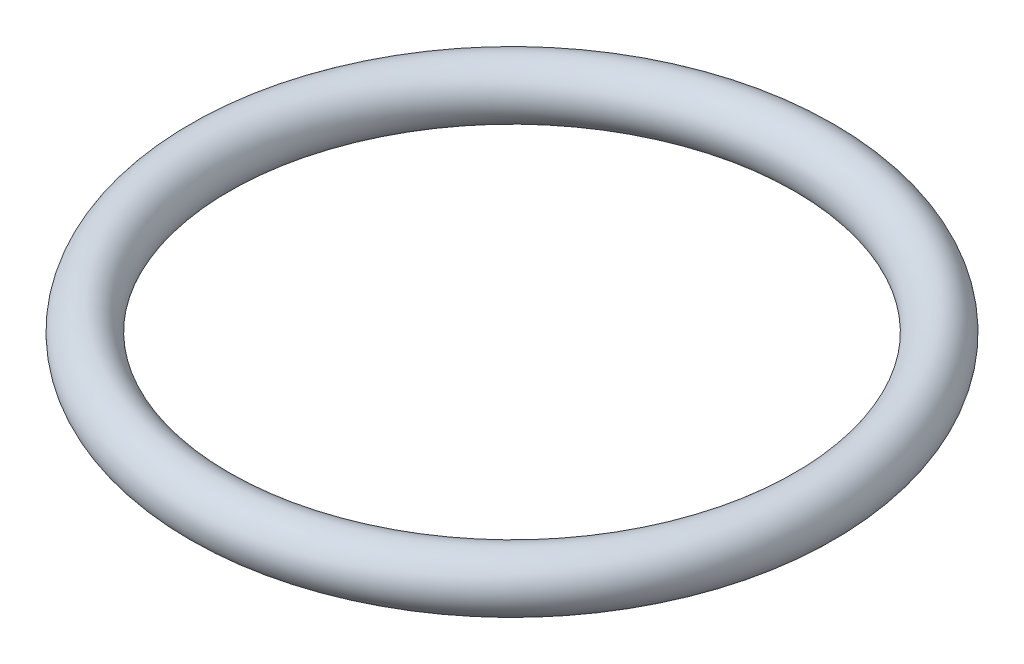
from build123d import *

# Parameters (mm, degrees)
ESQUISSE1_R = 2


with BuildPart() as part:
    # Esquisse1 → R_volution1 (revolve)
    with BuildSketch(Plane.XY, mode=Mode.PRIVATE) as r_volution1_sk:
        with Locations((22, 2)):
            Circle(ESQUISSE1_R)
    revolve(r_volution1_sk.sketch.rotate(Axis((0, 0, 0), (0, 1, 0)), 90), axis=Axis((0, 0, 0), (0, 1, 0)))


solid = part.part
